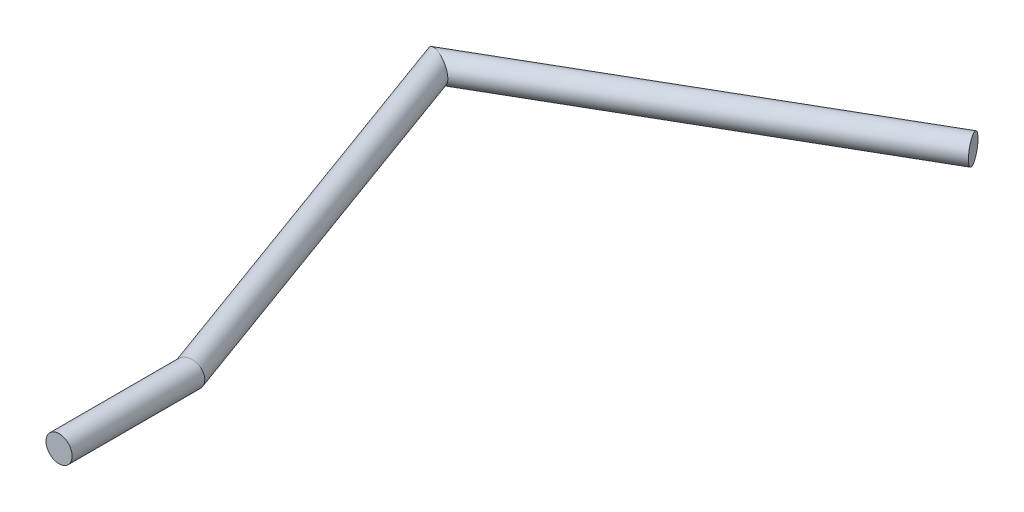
from build123d import *

# Parameters (mm, degrees)
SKETCH2_R = 5


with BuildPart() as part:
    # Sweep1: sweep along a path in Sketch1
    with BuildLine(Plane(origin=(0, 0, 0), x_dir=(1, 0, 0), z_dir=(0, 1, 0))) as sweep1_path:
        Line((0, 0), (0, 49.884453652))
        Line((0, 49.884453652), (-54.341204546, 199.185686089))
        Line((-54.341204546, 199.185686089), (75.562606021, 274.185686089))
    # Sketch2 → Sweep1 (sweep)
    with BuildSketch(Plane.XY):
        Circle(SKETCH2_R)
    sweep(path=sweep1_path.line, transition=Transition.RIGHT)


solid = part.part
